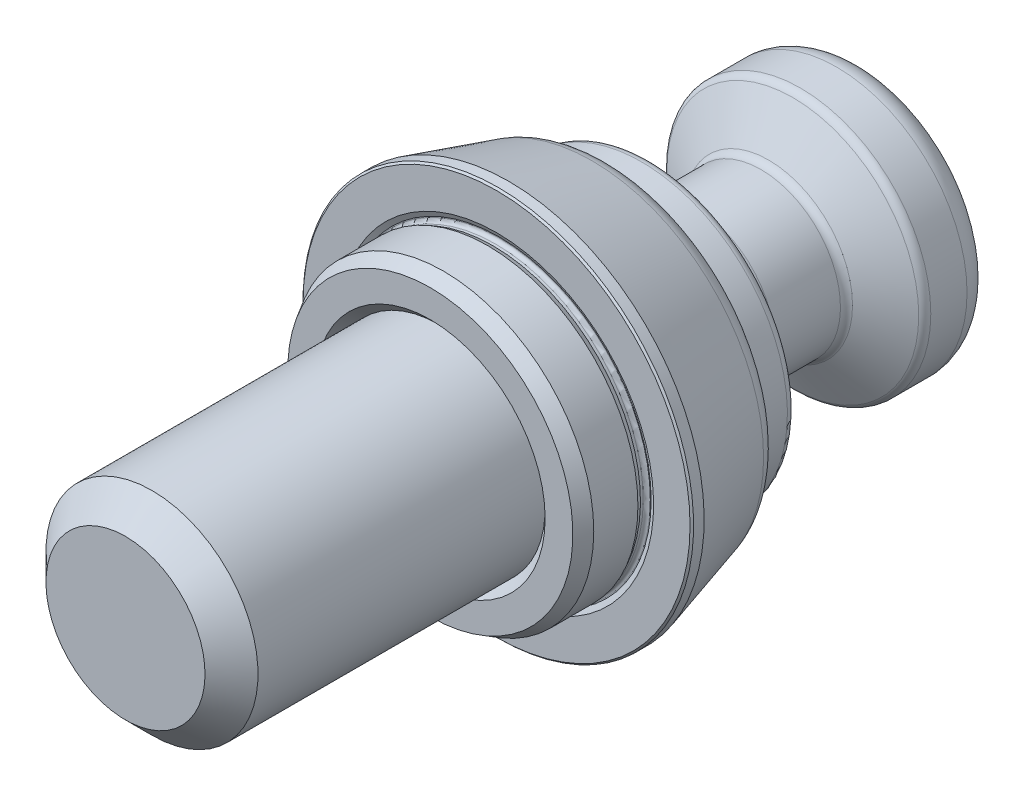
ISO-10303-21;
HEADER;
FILE_DESCRIPTION(('STEP AP214'),'2;1');
FILE_NAME('part.step','',(''),(''),'','','');
FILE_SCHEMA(('AUTOMOTIVE_DESIGN { 1 0 10303 214 1 1 1 1 }'));
ENDSEC;
DATA;
#1=APPLICATION_CONTEXT('core data for automotive mechanical design processes');
#2=APPLICATION_PROTOCOL_DEFINITION('international standard','automotive_design',2000,#1);
#3=PRODUCT_CONTEXT('',#1,'mechanical');
#4=PRODUCT('Part','Part','',(#3));
#5=PRODUCT_RELATED_PRODUCT_CATEGORY('part','',(#4));
#6=PRODUCT_DEFINITION_FORMATION('','',#4);
#7=PRODUCT_DEFINITION_CONTEXT('part definition',#1,'design');
#8=PRODUCT_DEFINITION('design','',#6,#7);
#9=PRODUCT_DEFINITION_SHAPE('','',#8);
#10=(LENGTH_UNIT() NAMED_UNIT(*) SI_UNIT(.MILLI.,.METRE.));
#11=(NAMED_UNIT(*) PLANE_ANGLE_UNIT() SI_UNIT($,.RADIAN.));
#12=(NAMED_UNIT(*) SI_UNIT($,.STERADIAN.) SOLID_ANGLE_UNIT());
#13=UNCERTAINTY_MEASURE_WITH_UNIT(LENGTH_MEASURE(1.E-05),#10,'distance_accuracy_value','');
#14=(GEOMETRIC_REPRESENTATION_CONTEXT(3) GLOBAL_UNCERTAINTY_ASSIGNED_CONTEXT((#13)) GLOBAL_UNIT_ASSIGNED_CONTEXT((#10,
#11,#12)) REPRESENTATION_CONTEXT('',''));
#15=CARTESIAN_POINT('',(0.,0.,0.));
#16=DIRECTION('',(0.,0.,1.));
#17=DIRECTION('',(1.,0.,0.));
#18=AXIS2_PLACEMENT_3D('',#15,#16,#17);
#19=CARTESIAN_POINT('',(17.1,0.,-0.3));
#20=DIRECTION('',(0.,0.,-1.));
#21=DIRECTION('',(0.,1.,0.));
#22=AXIS2_PLACEMENT_3D('',#19,#20,#21);
#23=PLANE('',#22);
#24=CARTESIAN_POINT('',(0.,0.,-0.3));
#25=DIRECTION('',(0.,0.,-1.));
#26=DIRECTION('',(0.,1.,0.));
#27=AXIS2_PLACEMENT_3D('',#24,#25,#26);
#28=CIRCLE('',#27,17.1978793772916);
#29=CARTESIAN_POINT('',(0.,17.1978793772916,-0.3));
#30=VERTEX_POINT('',#29);
#31=EDGE_CURVE('E581',#30,#30,#28,.T.);
#32=ORIENTED_EDGE('',*,*,#31,.F.);
#33=EDGE_LOOP('',(#32));
#34=FACE_BOUND('',#33,.T.);
#35=CARTESIAN_POINT('',(0.,0.,-0.3));
#36=DIRECTION('',(0.,0.,-1.));
#37=DIRECTION('',(0.,1.,0.));
#38=AXIS2_PLACEMENT_3D('',#35,#36,#37);
#39=CIRCLE('',#38,17.1);
#40=CARTESIAN_POINT('',(0.,17.1,-0.3));
#41=VERTEX_POINT('',#40);
#42=EDGE_CURVE('E89',#41,#41,#39,.T.);
#43=ORIENTED_EDGE('',*,*,#42,.T.);
#44=EDGE_LOOP('',(#43));
#45=FACE_BOUND('',#44,.T.);
#46=ADVANCED_FACE('F14',(#34,#45),#23,.F.);
#47=CARTESIAN_POINT('',(0.,0.,0.1));
#48=DIRECTION('',(0.,0.,-1.));
#49=DIRECTION('',(0.,1.,0.));
#50=AXIS2_PLACEMENT_3D('',#47,#48,#49);
#51=TOROIDAL_SURFACE('',#50,17.1,0.4);
#52=ORIENTED_EDGE('',*,*,#42,.F.);
#53=EDGE_LOOP('',(#52));
#54=FACE_BOUND('',#53,.T.);
#55=CARTESIAN_POINT('',(0.,0.,0.1));
#56=DIRECTION('',(0.,0.,-1.));
#57=DIRECTION('',(0.,1.,0.));
#58=AXIS2_PLACEMENT_3D('',#55,#56,#57);
#59=CIRCLE('',#58,16.7);
#60=CARTESIAN_POINT('',(0.,16.7,0.1));
#61=VERTEX_POINT('',#60);
#62=EDGE_CURVE('E596',#61,#61,#59,.T.);
#63=ORIENTED_EDGE('',*,*,#62,.T.);
#64=EDGE_LOOP('',(#63));
#65=FACE_BOUND('',#64,.T.);
#66=ADVANCED_FACE('F556',(#54,#65),#51,.F.);
#67=CARTESIAN_POINT('',(0.,0.,0.));
#68=DIRECTION('',(0.,0.,-1.));
#69=DIRECTION('',(0.,1.,0.));
#70=AXIS2_PLACEMENT_3D('',#67,#68,#69);
#71=CYLINDRICAL_SURFACE('',#70,16.7);
#72=ORIENTED_EDGE('',*,*,#62,.F.);
#73=EDGE_LOOP('',(#72));
#74=FACE_BOUND('',#73,.T.);
#75=CARTESIAN_POINT('',(0.,0.,0.411216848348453));
#76=DIRECTION('',(0.,0.,-1.));
#77=DIRECTION('',(0.,1.,0.));
#78=AXIS2_PLACEMENT_3D('',#75,#76,#77);
#79=CIRCLE('',#78,16.7);
#80=CARTESIAN_POINT('',(0.,16.7,0.411216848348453));
#81=VERTEX_POINT('',#80);
#82=EDGE_CURVE('E593',#81,#81,#79,.T.);
#83=ORIENTED_EDGE('',*,*,#82,.T.);
#84=EDGE_LOOP('',(#83));
#85=FACE_BOUND('',#84,.T.);
#86=ADVANCED_FACE('F546',(#74,#85),#71,.T.);
#87=CARTESIAN_POINT('',(0.,0.,1.));
#88=DIRECTION('',(0.,0.,1.));
#89=DIRECTION('',(0.,-1.,0.));
#90=AXIS2_PLACEMENT_3D('',#87,#88,#89);
#91=CONICAL_SURFACE('',#90,17.,0.47123889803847);
#92=ORIENTED_EDGE('',*,*,#82,.F.);
#93=EDGE_LOOP('',(#92));
#94=FACE_BOUND('',#93,.T.);
#95=CARTESIAN_POINT('',(0.,0.,1.));
#96=DIRECTION('',(0.,0.,-1.));
#97=DIRECTION('',(0.,1.,0.));
#98=AXIS2_PLACEMENT_3D('',#95,#96,#97);
#99=CIRCLE('',#98,17.);
#100=CARTESIAN_POINT('',(0.,17.,1.));
#101=VERTEX_POINT('',#100);
#102=EDGE_CURVE('E590',#101,#101,#99,.T.);
#103=ORIENTED_EDGE('',*,*,#102,.T.);
#104=EDGE_LOOP('',(#103));
#105=FACE_BOUND('',#104,.T.);
#106=ADVANCED_FACE('F536',(#94,#105),#91,.T.);
#107=CARTESIAN_POINT('',(0.,0.,0.));
#108=DIRECTION('',(0.,0.,-1.));
#109=DIRECTION('',(0.,1.,0.));
#110=AXIS2_PLACEMENT_3D('',#107,#108,#109);
#111=CYLINDRICAL_SURFACE('',#110,17.);
#112=ORIENTED_EDGE('',*,*,#102,.F.);
#113=EDGE_LOOP('',(#112));
#114=FACE_BOUND('',#113,.T.);
#115=CARTESIAN_POINT('',(0.,0.,6.));
#116=DIRECTION('',(0.,0.,1.));
#117=DIRECTION('',(0.,-1.,0.));
#118=AXIS2_PLACEMENT_3D('',#115,#116,#117);
#119=CIRCLE('',#118,17.);
#120=CARTESIAN_POINT('',(0.,-17.,6.));
#121=VERTEX_POINT('',#120);
#122=EDGE_CURVE('E608',#121,#121,#119,.F.);
#123=ORIENTED_EDGE('',*,*,#122,.T.);
#124=EDGE_LOOP('',(#123));
#125=FACE_BOUND('',#124,.T.);
#126=ADVANCED_FACE('F526',(#114,#125),#111,.T.);
#127=CARTESIAN_POINT('',(0.,0.,6.));
#128=DIRECTION('',(0.,0.,-1.));
#129=DIRECTION('',(0.,1.,0.));
#130=AXIS2_PLACEMENT_3D('',#127,#128,#129);
#131=CONICAL_SURFACE('',#130,17.,0.523598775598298);
#132=CARTESIAN_POINT('',(0.,0.,7.5));
#133=DIRECTION('',(0.,0.,1.));
#134=DIRECTION('',(0.,-1.,0.));
#135=AXIS2_PLACEMENT_3D('',#132,#133,#134);
#136=CIRCLE('',#135,16.1339745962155);
#137=CARTESIAN_POINT('',(0.,-16.1339745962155,7.5));
#138=VERTEX_POINT('',#137);
#139=EDGE_CURVE('E611',#138,#138,#136,.T.);
#140=ORIENTED_EDGE('',*,*,#139,.F.);
#141=EDGE_LOOP('',(#140));
#142=FACE_BOUND('',#141,.T.);
#143=ORIENTED_EDGE('',*,*,#122,.F.);
#144=EDGE_LOOP('',(#143));
#145=FACE_BOUND('',#144,.T.);
#146=ADVANCED_FACE('F516',(#142,#145),#131,.T.);
#147=CARTESIAN_POINT('',(12.,0.,7.5));
#148=DIRECTION('',(0.,0.,1.));
#149=DIRECTION('',(0.,-1.,0.));
#150=AXIS2_PLACEMENT_3D('',#147,#148,#149);
#151=PLANE('',#150);
#152=CARTESIAN_POINT('',(0.,0.,7.5));
#153=DIRECTION('',(0.,0.,1.));
#154=DIRECTION('',(0.,-1.,0.));
#155=AXIS2_PLACEMENT_3D('',#152,#153,#154);
#156=CIRCLE('',#155,13.);
#157=CARTESIAN_POINT('',(0.,-13.,7.5));
#158=VERTEX_POINT('',#157);
#159=EDGE_CURVE('E614',#158,#158,#156,.F.);
#160=ORIENTED_EDGE('',*,*,#159,.T.);
#161=EDGE_LOOP('',(#160));
#162=FACE_BOUND('',#161,.T.);
#163=ORIENTED_EDGE('',*,*,#139,.T.);
#164=EDGE_LOOP('',(#163));
#165=FACE_BOUND('',#164,.T.);
#166=ADVANCED_FACE('F507',(#162,#165),#151,.T.);
#167=CARTESIAN_POINT('',(0.,0.,7.5));
#168=DIRECTION('',(0.,0.,1.));
#169=DIRECTION('',(0.,-1.,0.));
#170=AXIS2_PLACEMENT_3D('',#167,#168,#169);
#171=CONICAL_SURFACE('',#170,13.,0.785398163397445);
#172=CARTESIAN_POINT('',(0.,0.,6.5));
#173=DIRECTION('',(0.,0.,1.));
#174=DIRECTION('',(0.,-1.,0.));
#175=AXIS2_PLACEMENT_3D('',#172,#173,#174);
#176=CIRCLE('',#175,12.);
#177=CARTESIAN_POINT('',(0.,-12.,6.5));
#178=VERTEX_POINT('',#177);
#179=EDGE_CURVE('E617',#178,#178,#176,.T.);
#180=ORIENTED_EDGE('',*,*,#179,.F.);
#181=EDGE_LOOP('',(#180));
#182=FACE_BOUND('',#181,.T.);
#183=ORIENTED_EDGE('',*,*,#159,.F.);
#184=EDGE_LOOP('',(#183));
#185=FACE_BOUND('',#184,.T.);
#186=ADVANCED_FACE('F497',(#182,#185),#171,.F.);
#187=CARTESIAN_POINT('',(0.,0.,-0.3));
#188=DIRECTION('',(0.,0.,1.));
#189=DIRECTION('',(0.,-1.,0.));
#190=AXIS2_PLACEMENT_3D('',#187,#188,#189);
#191=CONICAL_SURFACE('',#190,17.1978793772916,1.09083078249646);
#192=CARTESIAN_POINT('',(0.,0.,0.));
#193=DIRECTION('',(0.,0.,-1.));
#194=DIRECTION('',(0.,1.,0.));
#195=AXIS2_PLACEMENT_3D('',#192,#193,#194);
#196=CIRCLE('',#195,17.774174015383);
#197=CARTESIAN_POINT('',(0.,17.774174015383,0.));
#198=VERTEX_POINT('',#197);
#199=EDGE_CURVE('E585',#198,#198,#196,.T.);
#200=ORIENTED_EDGE('',*,*,#199,.F.);
#201=EDGE_LOOP('',(#200));
#202=FACE_BOUND('',#201,.T.);
#203=ORIENTED_EDGE('',*,*,#31,.T.);
#204=EDGE_LOOP('',(#203));
#205=FACE_BOUND('',#204,.T.);
#206=ADVANCED_FACE('F487',(#202,#205),#191,.F.);
#207=CARTESIAN_POINT('',(17.,0.,0.));
#208=DIRECTION('',(0.,0.,1.));
#209=DIRECTION('',(0.,-1.,0.));
#210=AXIS2_PLACEMENT_3D('',#207,#208,#209);
#211=PLANE('',#210);
#212=ORIENTED_EDGE('',*,*,#199,.T.);
#213=EDGE_LOOP('',(#212));
#214=FACE_BOUND('',#213,.T.);
#215=CARTESIAN_POINT('',(0.,0.,0.));
#216=DIRECTION('',(0.,0.,1.));
#217=DIRECTION('',(0.,-1.,0.));
#218=AXIS2_PLACEMENT_3D('',#215,#216,#217);
#219=CIRCLE('',#218,21.9);
#220=CARTESIAN_POINT('',(0.,-21.9,0.));
#221=VERTEX_POINT('',#220);
#222=EDGE_CURVE('E29',#221,#221,#219,.T.);
#223=ORIENTED_EDGE('',*,*,#222,.T.);
#224=EDGE_LOOP('',(#223));
#225=FACE_BOUND('',#224,.T.);
#226=ADVANCED_FACE('F478',(#214,#225),#211,.T.);
#227=CARTESIAN_POINT('',(0.,0.,-0.199999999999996));
#228=DIRECTION('',(0.,0.,-1.));
#229=DIRECTION('',(0.,1.,0.));
#230=AXIS2_PLACEMENT_3D('',#227,#228,#229);
#231=CONICAL_SURFACE('',#230,22.1,0.785398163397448);
#232=ORIENTED_EDGE('',*,*,#222,.F.);
#233=EDGE_LOOP('',(#232));
#234=FACE_BOUND('',#233,.T.);
#235=CARTESIAN_POINT('',(0.,0.,-0.199999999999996));
#236=DIRECTION('',(0.,0.,1.));
#237=DIRECTION('',(0.,-1.,0.));
#238=AXIS2_PLACEMENT_3D('',#235,#236,#237);
#239=CIRCLE('',#238,22.1);
#240=CARTESIAN_POINT('',(0.,-22.1,-0.199999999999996));
#241=VERTEX_POINT('',#240);
#242=EDGE_CURVE('E620',#241,#241,#239,.F.);
#243=ORIENTED_EDGE('',*,*,#242,.F.);
#244=EDGE_LOOP('',(#243));
#245=FACE_BOUND('',#244,.T.);
#246=ADVANCED_FACE('F238',(#234,#245),#231,.T.);
#247=CARTESIAN_POINT('',(0.,0.,0.));
#248=DIRECTION('',(0.,0.,-1.));
#249=DIRECTION('',(0.,1.,0.));
#250=AXIS2_PLACEMENT_3D('',#247,#248,#249);
#251=CYLINDRICAL_SURFACE('',#250,22.1);
#252=ORIENTED_EDGE('',*,*,#242,.T.);
#253=EDGE_LOOP('',(#252));
#254=FACE_BOUND('',#253,.T.);
#255=CARTESIAN_POINT('',(0.,0.,-1.3949657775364));
#256=DIRECTION('',(0.,0.,-1.));
#257=DIRECTION('',(0.,1.,0.));
#258=AXIS2_PLACEMENT_3D('',#255,#256,#257);
#259=CIRCLE('',#258,22.1);
#260=CARTESIAN_POINT('',(0.,22.1,-1.3949657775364));
#261=VERTEX_POINT('',#260);
#262=EDGE_CURVE('E599',#261,#261,#259,.T.);
#263=ORIENTED_EDGE('',*,*,#262,.F.);
#264=EDGE_LOOP('',(#263));
#265=FACE_BOUND('',#264,.T.);
#266=ADVANCED_FACE('F459',(#254,#265),#251,.T.);
#267=CARTESIAN_POINT('',(0.,0.,-13.));
#268=DIRECTION('',(0.,0.,1.));
#269=DIRECTION('',(0.,-1.,0.));
#270=AXIS2_PLACEMENT_3D('',#267,#268,#269);
#271=CONICAL_SURFACE('',#270,18.7723099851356,0.279252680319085);
#272=CARTESIAN_POINT('',(0.,0.,-10.826912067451));
#273=DIRECTION('',(0.,0.,-1.));
#274=DIRECTION('',(0.,1.,0.));
#275=AXIS2_PLACEMENT_3D('',#272,#273,#274);
#276=CIRCLE('',#275,19.3954329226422);
#277=CARTESIAN_POINT('',(0.,19.3954329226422,-10.826912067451));
#278=VERTEX_POINT('',#277);
#279=EDGE_CURVE('E605',#278,#278,#276,.F.);
#280=ORIENTED_EDGE('',*,*,#279,.T.);
#281=EDGE_LOOP('',(#280));
#282=FACE_BOUND('',#281,.T.);
#283=ORIENTED_EDGE('',*,*,#262,.T.);
#284=EDGE_LOOP('',(#283));
#285=FACE_BOUND('',#284,.T.);
#286=ADVANCED_FACE('F449',(#282,#285),#271,.T.);
#287=CARTESIAN_POINT('',(0.,0.,-10.));
#288=DIRECTION('',(0.,0.,-1.));
#289=DIRECTION('',(0.,1.,0.));
#290=AXIS2_PLACEMENT_3D('',#287,#288,#289);
#291=TOROIDAL_SURFACE('',#290,16.5116478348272,3.);
#292=ORIENTED_EDGE('',*,*,#279,.F.);
#293=EDGE_LOOP('',(#292));
#294=FACE_BOUND('',#293,.T.);
#295=CARTESIAN_POINT('',(0.,0.,-13.));
#296=DIRECTION('',(0.,0.,-1.));
#297=DIRECTION('',(0.,1.,0.));
#298=AXIS2_PLACEMENT_3D('',#295,#296,#297);
#299=CIRCLE('',#298,16.5116478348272);
#300=CARTESIAN_POINT('',(0.,16.5116478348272,-13.));
#301=VERTEX_POINT('',#300);
#302=EDGE_CURVE('E602',#301,#301,#299,.T.);
#303=ORIENTED_EDGE('',*,*,#302,.F.);
#304=EDGE_LOOP('',(#303));
#305=FACE_BOUND('',#304,.T.);
#306=ADVANCED_FACE('F439',(#294,#305),#291,.T.);
#307=CARTESIAN_POINT('',(12.,0.,-13.));
#308=DIRECTION('',(0.,0.,-1.));
#309=DIRECTION('',(0.,1.,0.));
#310=AXIS2_PLACEMENT_3D('',#307,#308,#309);
#311=PLANE('',#310);
#312=CARTESIAN_POINT('',(0.,0.,-13.));
#313=DIRECTION('',(0.,0.,-1.));
#314=DIRECTION('',(-1.,0.,0.));
#315=AXIS2_PLACEMENT_3D('',#312,#313,#314);
#316=CIRCLE('',#315,16.);
#317=CARTESIAN_POINT('',(-16.,0.,-13.));
#318=VERTEX_POINT('',#317);
#319=EDGE_CURVE('E9',#318,#318,#316,.T.);
#320=ORIENTED_EDGE('',*,*,#319,.F.);
#321=EDGE_LOOP('',(#320));
#322=FACE_BOUND('',#321,.T.);
#323=ORIENTED_EDGE('',*,*,#302,.T.);
#324=EDGE_LOOP('',(#323));
#325=FACE_BOUND('',#324,.T.);
#326=ADVANCED_FACE('F153',(#322,#325),#311,.T.);
#327=CARTESIAN_POINT('',(0.,0.,42.));
#328=DIRECTION('',(0.,0.,1.));
#329=DIRECTION('',(0.,1.,0.));
#330=AXIS2_PLACEMENT_3D('',#327,#328,#329);
#331=PLANE('',#330);
#332=CARTESIAN_POINT('',(0.,0.,42.));
#333=DIRECTION('',(0.,0.,1.));
#334=DIRECTION('',(0.,1.,0.));
#335=AXIS2_PLACEMENT_3D('',#332,#333,#334);
#336=CIRCLE('',#335,9.);
#337=CARTESIAN_POINT('',(0.,9.,42.));
#338=VERTEX_POINT('',#337);
#339=EDGE_CURVE('E130',#338,#338,#336,.T.);
#340=ORIENTED_EDGE('',*,*,#339,.T.);
#341=EDGE_LOOP('',(#340));
#342=FACE_BOUND('',#341,.T.);
#343=ADVANCED_FACE('F166',(#342),#331,.T.);
#344=CARTESIAN_POINT('',(0.,0.,39.));
#345=DIRECTION('',(0.,0.,-1.));
#346=DIRECTION('',(0.,-1.,0.));
#347=AXIS2_PLACEMENT_3D('',#344,#345,#346);
#348=CONICAL_SURFACE('',#347,12.,0.78539816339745);
#349=ORIENTED_EDGE('',*,*,#339,.F.);
#350=EDGE_LOOP('',(#349));
#351=FACE_BOUND('',#350,.T.);
#352=CARTESIAN_POINT('',(0.,0.,39.));
#353=DIRECTION('',(0.,0.,1.));
#354=DIRECTION('',(0.,1.,0.));
#355=AXIS2_PLACEMENT_3D('',#352,#353,#354);
#356=CIRCLE('',#355,12.);
#357=CARTESIAN_POINT('',(0.,12.,39.));
#358=VERTEX_POINT('',#357);
#359=EDGE_CURVE('E127',#358,#358,#356,.F.);
#360=ORIENTED_EDGE('',*,*,#359,.F.);
#361=EDGE_LOOP('',(#360));
#362=FACE_BOUND('',#361,.T.);
#363=ADVANCED_FACE('F163',(#351,#362),#348,.T.);
#364=CARTESIAN_POINT('',(0.,0.,-13.));
#365=DIRECTION('',(0.,0.,-1.));
#366=DIRECTION('',(0.,-1.,0.));
#367=AXIS2_PLACEMENT_3D('',#364,#365,#366);
#368=CYLINDRICAL_SURFACE('',#367,12.);
#369=ORIENTED_EDGE('',*,*,#359,.T.);
#370=EDGE_LOOP('',(#369));
#371=FACE_BOUND('',#370,.T.);
#372=ORIENTED_EDGE('',*,*,#179,.T.);
#373=EDGE_LOOP('',(#372));
#374=FACE_BOUND('',#373,.T.);
#375=ADVANCED_FACE('F165',(#371,#374),#368,.T.);
#376=CARTESIAN_POINT('',(0.,0.,-36.));
#377=DIRECTION('',(0.,0.,-1.));
#378=DIRECTION('',(0.,-1.,0.));
#379=AXIS2_PLACEMENT_3D('',#376,#377,#378);
#380=PLANE('',#379);
#381=DIRECTION('',(-0.5,-0.866025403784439,0.));
#382=VECTOR('',#381,1.);
#383=CARTESIAN_POINT('',(4.61880215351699,0.,-36.));
#384=LINE('',#383,#382);
#385=CARTESIAN_POINT('',(4.61880215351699,0.,-36.));
#386=VERTEX_POINT('',#385);
#387=CARTESIAN_POINT('',(2.30940107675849,-4.,-36.));
#388=VERTEX_POINT('',#387);
#389=EDGE_CURVE('E99',#386,#388,#384,.T.);
#390=ORIENTED_EDGE('',*,*,#389,.T.);
#391=DIRECTION('',(-1.,0.,0.));
#392=VECTOR('',#391,1.);
#393=CARTESIAN_POINT('',(2.30940107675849,-4.,-36.));
#394=LINE('',#393,#392);
#395=CARTESIAN_POINT('',(-2.30940107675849,-4.,-36.));
#396=VERTEX_POINT('',#395);
#397=EDGE_CURVE('E95',#388,#396,#394,.T.);
#398=ORIENTED_EDGE('',*,*,#397,.T.);
#399=DIRECTION('',(-0.5,0.86602540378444,0.));
#400=VECTOR('',#399,1.);
#401=CARTESIAN_POINT('',(-2.30940107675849,-4.,-36.));
#402=LINE('',#401,#400);
#403=CARTESIAN_POINT('',(-4.61880215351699,0.,-36.));
#404=VERTEX_POINT('',#403);
#405=EDGE_CURVE('E45',#396,#404,#402,.T.);
#406=ORIENTED_EDGE('',*,*,#405,.T.);
#407=DIRECTION('',(0.5,0.866025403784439,0.));
#408=VECTOR('',#407,1.);
#409=CARTESIAN_POINT('',(-4.61880215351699,0.,-36.));
#410=LINE('',#409,#408);
#411=CARTESIAN_POINT('',(-2.30940107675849,4.,-36.));
#412=VERTEX_POINT('',#411);
#413=EDGE_CURVE('E93',#404,#412,#410,.T.);
#414=ORIENTED_EDGE('',*,*,#413,.T.);
#415=DIRECTION('',(1.,0.,0.));
#416=VECTOR('',#415,1.);
#417=CARTESIAN_POINT('',(-2.30940107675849,4.,-36.));
#418=LINE('',#417,#416);
#419=CARTESIAN_POINT('',(2.30940107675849,4.,-36.));
#420=VERTEX_POINT('',#419);
#421=EDGE_CURVE('E278',#412,#420,#418,.T.);
#422=ORIENTED_EDGE('',*,*,#421,.T.);
#423=DIRECTION('',(0.5,-0.866025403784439,0.));
#424=VECTOR('',#423,1.);
#425=CARTESIAN_POINT('',(2.30940107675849,4.,-36.));
#426=LINE('',#425,#424);
#427=EDGE_CURVE('E281',#420,#386,#426,.T.);
#428=ORIENTED_EDGE('',*,*,#427,.T.);
#429=EDGE_LOOP('',(#390,#398,#406,#414,#422,#428));
#430=FACE_BOUND('',#429,.T.);
#431=ADVANCED_FACE('F158',(#430),#380,.T.);
#432=CARTESIAN_POINT('',(4.61880215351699,0.,-36.));
#433=DIRECTION('',(0.866025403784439,-0.5,0.));
#434=DIRECTION('',(0.5,0.866025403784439,0.));
#435=AXIS2_PLACEMENT_3D('',#432,#433,#434);
#436=PLANE('',#435);
#437=DIRECTION('',(0.,0.,-1.));
#438=VECTOR('',#437,1.);
#439=CARTESIAN_POINT('',(4.61880215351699,0.,-36.));
#440=LINE('',#439,#438);
#441=CARTESIAN_POINT('',(4.61880215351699,0.,-41.2799153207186));
#442=VERTEX_POINT('',#441);
#443=EDGE_CURVE('E292',#386,#442,#440,.T.);
#444=ORIENTED_EDGE('',*,*,#443,.T.);
#445=CARTESIAN_POINT('',(4.61891762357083,0.000199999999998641,-41.2799819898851));
#446=CARTESIAN_POINT('',(4.51743148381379,-0.175579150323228,-41.2213676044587));
#447=CARTESIAN_POINT('',(4.4150693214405,-0.352875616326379,-41.1680600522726));
#448=CARTESIAN_POINT('',(4.20857250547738,-0.710538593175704,-41.0750114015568));
#449=CARTESIAN_POINT('',(4.10443418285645,-0.890911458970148,-41.0353032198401));
#450=CARTESIAN_POINT('',(3.89744813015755,-1.24942181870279,-40.9734919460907));
#451=CARTESIAN_POINT('',(3.79463224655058,-1.42750415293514,-40.9509774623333));
#452=CARTESIAN_POINT('',(3.58851671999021,-1.7845067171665,-40.924100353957));
#453=CARTESIAN_POINT('',(3.48521782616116,-1.96342564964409,-40.9197154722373));
#454=CARTESIAN_POINT('',(3.29219970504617,-2.29774284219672,-40.9288398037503));
#455=CARTESIAN_POINT('',(3.20245157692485,-2.45319115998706,-40.9401086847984));
#456=CARTESIAN_POINT('',(3.02354002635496,-2.76307505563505,-40.9758237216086));
#457=CARTESIAN_POINT('',(2.93437722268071,-2.91750956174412,-41.0002820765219));
#458=CARTESIAN_POINT('',(2.75509682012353,-3.22803232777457,-41.0614257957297));
#459=CARTESIAN_POINT('',(2.66500191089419,-3.3840812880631,-41.0983703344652));
#460=CARTESIAN_POINT('',(2.48615580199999,-3.69385183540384,-41.1822198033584));
#461=CARTESIAN_POINT('',(2.39740231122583,-3.84757739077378,-41.2291050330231));
#462=CARTESIAN_POINT('',(2.30928560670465,-4.0002,-41.2799819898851));
#463=B_SPLINE_CURVE_WITH_KNOTS('',3,(#445,#446,#447,#448,#449,#450,#451,#452,#453,#454,#455,
#456,#457,#458,#459,#460,#461,#462),.UNSPECIFIED.,.F.,.F.,(4,2,2,2,2,2,2,2,4),(0.,
0.634047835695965,1.26961969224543,1.88946157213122,2.50854226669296,3.04757825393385,
3.58711366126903,4.13861653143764,4.68903648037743),.UNSPECIFIED.);
#464=CARTESIAN_POINT('',(2.30940107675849,-4.,-41.2799153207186));
#465=VERTEX_POINT('',#464);
#466=EDGE_CURVE('E251',#442,#465,#463,.T.);
#467=ORIENTED_EDGE('',*,*,#466,.T.);
#468=DIRECTION('',(0.,0.,-1.));
#469=VECTOR('',#468,1.);
#470=CARTESIAN_POINT('',(2.30940107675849,-4.,-36.));
#471=LINE('',#470,#469);
#472=EDGE_CURVE('E289',#388,#465,#471,.T.);
#473=ORIENTED_EDGE('',*,*,#472,.F.);
#474=ORIENTED_EDGE('',*,*,#389,.F.);
#475=EDGE_LOOP('',(#444,#467,#473,#474));
#476=FACE_BOUND('',#475,.T.);
#477=ADVANCED_FACE('F260',(#476),#436,.F.);
#478=CARTESIAN_POINT('',(2.30940107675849,-4.,-36.));
#479=DIRECTION('',(0.,-1.,0.));
#480=DIRECTION('',(1.,0.,0.));
#481=AXIS2_PLACEMENT_3D('',#478,#479,#480);
#482=PLANE('',#481);
#483=ORIENTED_EDGE('',*,*,#472,.T.);
#484=CARTESIAN_POINT('',(6.15545088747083,-4.,-42.8515492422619));
#485=CARTESIAN_POINT('',(5.98114186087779,-4.,-42.7671874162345));
#486=CARTESIAN_POINT('',(5.80642751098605,-4.,-42.683648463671));
#487=CARTESIAN_POINT('',(5.45597243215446,-4.,-42.5186800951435));
#488=CARTESIAN_POINT('',(5.28023154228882,-4.,-42.4372510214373));
#489=CARTESIAN_POINT('',(4.92657895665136,-4.,-42.276546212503));
#490=CARTESIAN_POINT('',(4.74866061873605,-4.,-42.1972850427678));
#491=CARTESIAN_POINT('',(4.39139197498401,-4.,-42.0420709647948));
#492=CARTESIAN_POINT('',(4.21204173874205,-4.,-41.9661178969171));
#493=CARTESIAN_POINT('',(3.84601982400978,-4.,-41.8160980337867));
#494=CARTESIAN_POINT('',(3.65929378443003,-4.,-41.7421631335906));
#495=CARTESIAN_POINT('',(3.28363946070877,-4.,-41.6000059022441));
#496=CARTESIAN_POINT('',(3.09471092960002,-4.,-41.5317842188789));
#497=CARTESIAN_POINT('',(2.7147205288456,-4.,-41.4028795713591));
#498=CARTESIAN_POINT('',(2.52366403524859,-4.,-41.3421809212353));
#499=CARTESIAN_POINT('',(2.13881115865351,-4.,-41.2303016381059));
#500=CARTESIAN_POINT('',(1.94501567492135,-4.,-41.1791179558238));
#501=CARTESIAN_POINT('',(1.5556428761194,-4.,-41.0890262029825));
#502=CARTESIAN_POINT('',(1.36008084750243,-4.,-41.0500532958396));
#503=CARTESIAN_POINT('',(0.966575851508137,-4.,-40.9866183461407));
#504=CARTESIAN_POINT('',(0.768633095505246,-4.,-40.9621550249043));
#505=CARTESIAN_POINT('',(0.373920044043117,-4.,-40.9300119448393));
#506=CARTESIAN_POINT('',(0.177167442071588,-4.,-40.9221202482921));
#507=CARTESIAN_POINT('',(-0.216304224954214,-4.,-40.9232344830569));
#508=CARTESIAN_POINT('',(-0.413023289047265,-4.,-40.9322408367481));
#509=CARTESIAN_POINT('',(-0.748437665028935,-4.,-40.9613733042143));
#510=CARTESIAN_POINT('',(-0.887496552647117,-4.,-40.9775408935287));
#511=CARTESIAN_POINT('',(-1.16455854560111,-4.,-41.0172870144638));
#512=CARTESIAN_POINT('',(-1.30256149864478,-4.,-41.0408665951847));
#513=CARTESIAN_POINT('',(-1.71482433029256,-4.,-41.1214799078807));
#514=CARTESIAN_POINT('',(-1.98717590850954,-4.,-41.1883722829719));
#515=CARTESIAN_POINT('',(-2.39434499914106,-4.,-41.3038808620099));
#516=CARTESIAN_POINT('',(-2.53128526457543,-4.,-41.3454363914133));
#517=CARTESIAN_POINT('',(-2.80383477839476,-4.,-41.4327425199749));
#518=CARTESIAN_POINT('',(-2.93944401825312,-4.,-41.4784931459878));
#519=CARTESIAN_POINT('',(-3.2093767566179,-4.,-41.5734654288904));
#520=CARTESIAN_POINT('',(-3.34370069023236,-4.,-41.6226858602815));
#521=CARTESIAN_POINT('',(-3.61124396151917,-4.,-41.7240308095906));
#522=CARTESIAN_POINT('',(-3.74446330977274,-4.,-41.7761552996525));
#523=CARTESIAN_POINT('',(-4.04870128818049,-4.,-41.8984071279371));
#524=CARTESIAN_POINT('',(-4.21939338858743,-4.,-41.9693453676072));
#525=CARTESIAN_POINT('',(-4.55940655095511,-4.,-42.1144431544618));
#526=CARTESIAN_POINT('',(-4.7287275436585,-4.,-42.1886028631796));
#527=CARTESIAN_POINT('',(-5.06623845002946,-4.,-42.3395234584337));
#528=CARTESIAN_POINT('',(-5.2344281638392,-4.,-42.4162847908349));
#529=CARTESIAN_POINT('',(-5.56983155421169,-4.,-42.5719139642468));
#530=CARTESIAN_POINT('',(-5.73704521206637,-4.,-42.6507818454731));
#531=CARTESIAN_POINT('',(-6.2377505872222,-4.,-42.8900959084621));
#532=CARTESIAN_POINT('',(-6.57001042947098,-4.,-43.0531183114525));
#533=CARTESIAN_POINT('',(-7.23217091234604,-4.,-43.3838840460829));
#534=CARTESIAN_POINT('',(-7.56207147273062,-4.,-43.5516275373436));
#535=CARTESIAN_POINT('',(-8.19416831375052,-4.,-43.8771399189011));
#536=CARTESIAN_POINT('',(-8.49649716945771,-4.,-44.0346518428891));
#537=CARTESIAN_POINT('',(-9.10001953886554,-4.,-44.3518544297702));
#538=CARTESIAN_POINT('',(-9.40121301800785,-4.,-44.5115451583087));
#539=CARTESIAN_POINT('',(-10.0020291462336,-4.,-44.8322374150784));
#540=CARTESIAN_POINT('',(-10.3016538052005,-4.,-44.9932351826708));
#541=CARTESIAN_POINT('',(-10.9001707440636,-4.,-45.3165512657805));
#542=CARTESIAN_POINT('',(-11.1990630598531,-4.,-45.4788695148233));
#543=CARTESIAN_POINT('',(-11.4976828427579,-4.,-45.641684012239));
#544=B_SPLINE_CURVE_WITH_KNOTS('',3,(#484,#485,#486,#487,#488,#489,#490,#491,#492,#493,#494,
#495,#496,#497,#498,#499,#500,#501,#502,#503,#504,#505,#506,#507,#508,#509,#510,#511,#512,#513,
#514,#515,#516,#517,#518,#519,#520,#521,#522,#523,#524,#525,#526,#527,#528,#529,#530,#531,#532,
#533,#534,#535,#536,#537,#538,#539,#540,#541,#542,#543),.UNSPECIFIED.,.F.,.F.,(4,2,2,2,2,2,2,2,
2,2,2,2,2,2,2,2,2,2,2,2,2,2,2,2,2,2,2,2,2,4),(0.,0.58095913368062,1.16201192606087,
1.74630973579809,2.33057931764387,2.93299929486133,3.53548748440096,4.13669752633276,
4.73771456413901,5.33548401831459,5.93320078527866,6.5232254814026,7.11326492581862,
7.53304708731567,7.95288869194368,8.79305885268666,9.22234391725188,9.65163173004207,
10.0807686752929,10.5099015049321,11.0643958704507,11.6189180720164,12.1735357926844,
12.7281641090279,13.838396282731,14.9486660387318,15.9713541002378,16.9940730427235,
18.0144894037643,19.0348547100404),.UNSPECIFIED.);
#545=CARTESIAN_POINT('',(-2.30940107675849,-4.,-41.2799153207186));
#546=VERTEX_POINT('',#545);
#547=EDGE_CURVE('E83',#465,#546,#544,.T.);
#548=ORIENTED_EDGE('',*,*,#547,.T.);
#549=DIRECTION('',(0.,0.,-1.));
#550=VECTOR('',#549,1.);
#551=CARTESIAN_POINT('',(-2.30940107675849,-4.,-36.));
#552=LINE('',#551,#550);
#553=EDGE_CURVE('E81',#396,#546,#552,.T.);
#554=ORIENTED_EDGE('',*,*,#553,.F.);
#555=ORIENTED_EDGE('',*,*,#397,.F.);
#556=EDGE_LOOP('',(#483,#548,#554,#555));
#557=FACE_BOUND('',#556,.T.);
#558=ADVANCED_FACE('F214',(#557),#482,.F.);
#559=CARTESIAN_POINT('',(-2.30940107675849,-4.,-36.));
#560=DIRECTION('',(-0.86602540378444,-0.5,0.));
#561=DIRECTION('',(0.5,-0.86602540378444,0.));
#562=AXIS2_PLACEMENT_3D('',#559,#560,#561);
#563=PLANE('',#562);
#564=ORIENTED_EDGE('',*,*,#553,.T.);
#565=CARTESIAN_POINT('',(-2.30928560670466,-4.0002,-41.2799819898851));
#566=CARTESIAN_POINT('',(-2.4107717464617,-3.82442084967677,-41.2213676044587));
#567=CARTESIAN_POINT('',(-2.51313390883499,-3.64712438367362,-41.1680600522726));
#568=CARTESIAN_POINT('',(-2.71963072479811,-3.28946140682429,-41.0750114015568));
#569=CARTESIAN_POINT('',(-2.82376904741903,-3.10908854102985,-41.0353032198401));
#570=CARTESIAN_POINT('',(-3.03075510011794,-2.75057818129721,-40.9734919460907));
#571=CARTESIAN_POINT('',(-3.13357098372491,-2.57249584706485,-40.9509774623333));
#572=CARTESIAN_POINT('',(-3.33968651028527,-2.21549328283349,-40.924100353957));
#573=CARTESIAN_POINT('',(-3.44298540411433,-2.03657435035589,-40.9197154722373));
#574=CARTESIAN_POINT('',(-3.63600352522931,-1.70225715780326,-40.9288398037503));
#575=CARTESIAN_POINT('',(-3.72575165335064,-1.54680884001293,-40.9401086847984));
#576=CARTESIAN_POINT('',(-3.90466320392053,-1.23692494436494,-40.9758237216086));
#577=CARTESIAN_POINT('',(-3.99382600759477,-1.08249043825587,-41.0002820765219));
#578=CARTESIAN_POINT('',(-4.17310641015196,-0.77196767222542,-41.0614257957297));
#579=CARTESIAN_POINT('',(-4.2632013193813,-0.615918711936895,-41.0983703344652));
#580=CARTESIAN_POINT('',(-4.44204742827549,-0.306148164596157,-41.1822198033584));
#581=CARTESIAN_POINT('',(-4.53080091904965,-0.152422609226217,-41.2291050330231));
#582=CARTESIAN_POINT('',(-4.61891762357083,0.00020000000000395,-41.2799819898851));
#583=B_SPLINE_CURVE_WITH_KNOTS('',3,(#565,#566,#567,#568,#569,#570,#571,#572,#573,#574,#575,
#576,#577,#578,#579,#580,#581,#582),.UNSPECIFIED.,.F.,.F.,(4,2,2,2,2,2,2,2,4),(0.,
0.634047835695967,1.26961969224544,1.88946157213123,2.50854226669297,3.04757825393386,
3.58711366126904,4.13861653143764,4.68903648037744),.UNSPECIFIED.);
#584=CARTESIAN_POINT('',(-4.61880215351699,0.,-41.2799153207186));
#585=VERTEX_POINT('',#584);
#586=EDGE_CURVE('E76',#546,#585,#583,.T.);
#587=ORIENTED_EDGE('',*,*,#586,.T.);
#588=DIRECTION('',(0.,0.,-1.));
#589=VECTOR('',#588,1.);
#590=CARTESIAN_POINT('',(-4.61880215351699,0.,-36.));
#591=LINE('',#590,#589);
#592=EDGE_CURVE('E79',#404,#585,#591,.T.);
#593=ORIENTED_EDGE('',*,*,#592,.F.);
#594=ORIENTED_EDGE('',*,*,#405,.F.);
#595=EDGE_LOOP('',(#564,#587,#593,#594));
#596=FACE_BOUND('',#595,.T.);
#597=ADVANCED_FACE('F77',(#596),#563,.F.);
#598=CARTESIAN_POINT('',(-4.61880215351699,0.,-36.));
#599=DIRECTION('',(-0.866025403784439,0.5,0.));
#600=DIRECTION('',(-0.5,-0.866025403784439,0.));
#601=AXIS2_PLACEMENT_3D('',#598,#599,#600);
#602=PLANE('',#601);
#603=ORIENTED_EDGE('',*,*,#592,.T.);
#604=CARTESIAN_POINT('',(-4.61891762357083,-0.00019999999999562,-41.2799819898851));
#605=CARTESIAN_POINT('',(-4.51743148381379,0.175579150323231,-41.2213676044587));
#606=CARTESIAN_POINT('',(-4.4150693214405,0.352875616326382,-41.1680600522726));
#607=CARTESIAN_POINT('',(-4.20857250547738,0.710538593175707,-41.0750114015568));
#608=CARTESIAN_POINT('',(-4.10443418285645,0.890911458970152,-41.0353032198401));
#609=CARTESIAN_POINT('',(-3.89744813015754,1.24942181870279,-40.9734919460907));
#610=CARTESIAN_POINT('',(-3.79463224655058,1.42750415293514,-40.9509774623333));
#611=CARTESIAN_POINT('',(-3.58851671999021,1.78450671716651,-40.924100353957));
#612=CARTESIAN_POINT('',(-3.48521782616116,1.9634256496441,-40.9197154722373));
#613=CARTESIAN_POINT('',(-3.29219970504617,2.29774284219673,-40.9288398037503));
#614=CARTESIAN_POINT('',(-3.20245157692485,2.45319115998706,-40.9401086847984));
#615=CARTESIAN_POINT('',(-3.02354002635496,2.76307505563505,-40.9758237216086));
#616=CARTESIAN_POINT('',(-2.93437722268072,2.91750956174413,-41.0002820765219));
#617=CARTESIAN_POINT('',(-2.75509682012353,3.22803232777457,-41.0614257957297));
#618=CARTESIAN_POINT('',(-2.66500191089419,3.3840812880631,-41.0983703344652));
#619=CARTESIAN_POINT('',(-2.48615580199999,3.69385183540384,-41.1822198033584));
#620=CARTESIAN_POINT('',(-2.39740231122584,3.84757739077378,-41.2291050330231));
#621=CARTESIAN_POINT('',(-2.30928560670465,4.0002,-41.2799819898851));
#622=B_SPLINE_CURVE_WITH_KNOTS('',3,(#604,#605,#606,#607,#608,#609,#610,#611,#612,#613,#614,
#615,#616,#617,#618,#619,#620,#621),.UNSPECIFIED.,.F.,.F.,(4,2,2,2,2,2,2,2,4),(0.,
0.634047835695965,1.26961969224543,1.88946157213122,2.50854226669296,3.04757825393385,
3.58711366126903,4.13861653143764,4.68903648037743),.UNSPECIFIED.);
#623=CARTESIAN_POINT('',(-2.30940107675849,4.,-41.2799153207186));
#624=VERTEX_POINT('',#623);
#625=EDGE_CURVE('E18',#585,#624,#622,.T.);
#626=ORIENTED_EDGE('',*,*,#625,.T.);
#627=DIRECTION('',(0.,0.,-1.));
#628=VECTOR('',#627,1.);
#629=CARTESIAN_POINT('',(-2.30940107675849,4.,-36.));
#630=LINE('',#629,#628);
#631=EDGE_CURVE('E94',#412,#624,#630,.T.);
#632=ORIENTED_EDGE('',*,*,#631,.F.);
#633=ORIENTED_EDGE('',*,*,#413,.F.);
#634=EDGE_LOOP('',(#603,#626,#632,#633));
#635=FACE_BOUND('',#634,.T.);
#636=ADVANCED_FACE('F91',(#635),#602,.F.);
#637=CARTESIAN_POINT('',(-2.30940107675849,4.,-36.));
#638=DIRECTION('',(0.,1.,0.));
#639=DIRECTION('',(-1.,0.,0.));
#640=AXIS2_PLACEMENT_3D('',#637,#638,#639);
#641=PLANE('',#640);
#642=ORIENTED_EDGE('',*,*,#631,.T.);
#643=CARTESIAN_POINT('',(6.15545088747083,4.,-42.8515492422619));
#644=CARTESIAN_POINT('',(5.98114186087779,4.,-42.7671874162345));
#645=CARTESIAN_POINT('',(5.80642751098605,4.,-42.683648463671));
#646=CARTESIAN_POINT('',(5.45597243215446,4.,-42.5186800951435));
#647=CARTESIAN_POINT('',(5.28023154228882,4.,-42.4372510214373));
#648=CARTESIAN_POINT('',(4.92657895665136,4.,-42.276546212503));
#649=CARTESIAN_POINT('',(4.74866061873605,4.,-42.1972850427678));
#650=CARTESIAN_POINT('',(4.39139197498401,4.,-42.0420709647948));
#651=CARTESIAN_POINT('',(4.21204173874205,4.,-41.9661178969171));
#652=CARTESIAN_POINT('',(3.84601982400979,4.,-41.8160980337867));
#653=CARTESIAN_POINT('',(3.65929378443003,4.,-41.7421631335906));
#654=CARTESIAN_POINT('',(3.28363946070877,4.,-41.6000059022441));
#655=CARTESIAN_POINT('',(3.09471092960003,4.,-41.531784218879));
#656=CARTESIAN_POINT('',(2.7147205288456,4.,-41.4028795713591));
#657=CARTESIAN_POINT('',(2.5236640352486,4.,-41.3421809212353));
#658=CARTESIAN_POINT('',(2.13881115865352,4.,-41.2303016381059));
#659=CARTESIAN_POINT('',(1.94501567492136,4.,-41.1791179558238));
#660=CARTESIAN_POINT('',(1.55564287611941,4.,-41.0890262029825));
#661=CARTESIAN_POINT('',(1.36008084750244,4.,-41.0500532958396));
#662=CARTESIAN_POINT('',(0.966575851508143,4.,-40.9866183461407));
#663=CARTESIAN_POINT('',(0.768633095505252,4.,-40.9621550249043));
#664=CARTESIAN_POINT('',(0.373920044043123,4.,-40.9300119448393));
#665=CARTESIAN_POINT('',(0.177167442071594,4.,-40.9221202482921));
#666=CARTESIAN_POINT('',(-0.216304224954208,4.,-40.9232344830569));
#667=CARTESIAN_POINT('',(-0.413023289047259,4.,-40.9322408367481));
#668=CARTESIAN_POINT('',(-0.748437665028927,4.,-40.9613733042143));
#669=CARTESIAN_POINT('',(-0.887496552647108,4.,-40.9775408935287));
#670=CARTESIAN_POINT('',(-1.1645585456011,4.,-41.0172870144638));
#671=CARTESIAN_POINT('',(-1.30256149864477,4.,-41.0408665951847));
#672=CARTESIAN_POINT('',(-1.71482433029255,4.,-41.1214799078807));
#673=CARTESIAN_POINT('',(-1.98717590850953,4.,-41.1883722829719));
#674=CARTESIAN_POINT('',(-2.39434499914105,4.,-41.3038808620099));
#675=CARTESIAN_POINT('',(-2.53128526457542,4.,-41.3454363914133));
#676=CARTESIAN_POINT('',(-2.80383477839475,4.,-41.4327425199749));
#677=CARTESIAN_POINT('',(-2.93944401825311,4.,-41.4784931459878));
#678=CARTESIAN_POINT('',(-3.20937675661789,4.,-41.5734654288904));
#679=CARTESIAN_POINT('',(-3.34370069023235,4.,-41.6226858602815));
#680=CARTESIAN_POINT('',(-3.61124396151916,4.,-41.7240308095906));
#681=CARTESIAN_POINT('',(-3.74446330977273,4.,-41.7761552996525));
#682=CARTESIAN_POINT('',(-4.04870128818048,4.,-41.8984071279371));
#683=CARTESIAN_POINT('',(-4.21939338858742,4.,-41.9693453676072));
#684=CARTESIAN_POINT('',(-4.55940655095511,4.,-42.1144431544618));
#685=CARTESIAN_POINT('',(-4.72872754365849,4.,-42.1886028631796));
#686=CARTESIAN_POINT('',(-5.06623845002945,4.,-42.3395234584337));
#687=CARTESIAN_POINT('',(-5.2344281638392,4.,-42.4162847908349));
#688=CARTESIAN_POINT('',(-5.56983155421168,4.,-42.5719139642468));
#689=CARTESIAN_POINT('',(-5.73704521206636,4.,-42.6507818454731));
#690=CARTESIAN_POINT('',(-6.23775058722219,4.,-42.8900959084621));
#691=CARTESIAN_POINT('',(-6.57001042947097,4.,-43.0531183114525));
#692=CARTESIAN_POINT('',(-7.23217091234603,4.,-43.3838840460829));
#693=CARTESIAN_POINT('',(-7.56207147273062,4.,-43.5516275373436));
#694=CARTESIAN_POINT('',(-8.19416831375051,4.,-43.8771399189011));
#695=CARTESIAN_POINT('',(-8.4964971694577,4.,-44.0346518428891));
#696=CARTESIAN_POINT('',(-9.10001953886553,4.,-44.3518544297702));
#697=CARTESIAN_POINT('',(-9.40121301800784,4.,-44.5115451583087));
#698=CARTESIAN_POINT('',(-10.0020291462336,4.,-44.8322374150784));
#699=CARTESIAN_POINT('',(-10.3016538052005,4.,-44.9932351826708));
#700=CARTESIAN_POINT('',(-10.9001707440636,4.,-45.3165512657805));
#701=CARTESIAN_POINT('',(-11.1990630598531,4.,-45.4788695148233));
#702=CARTESIAN_POINT('',(-11.4976828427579,4.,-45.641684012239));
#703=B_SPLINE_CURVE_WITH_KNOTS('',3,(#643,#644,#645,#646,#647,#648,#649,#650,#651,#652,#653,
#654,#655,#656,#657,#658,#659,#660,#661,#662,#663,#664,#665,#666,#667,#668,#669,#670,#671,#672,
#673,#674,#675,#676,#677,#678,#679,#680,#681,#682,#683,#684,#685,#686,#687,#688,#689,#690,#691,
#692,#693,#694,#695,#696,#697,#698,#699,#700,#701,#702),.UNSPECIFIED.,.F.,.F.,(4,2,2,2,2,2,2,2,
2,2,2,2,2,2,2,2,2,2,2,2,2,2,2,2,2,2,2,2,2,4),(0.,0.58095913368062,1.16201192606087,
1.74630973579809,2.33057931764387,2.93299929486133,3.53548748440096,4.13669752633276,
4.737714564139,5.33548401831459,5.93320078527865,6.5232254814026,7.11326492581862,
7.53304708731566,7.95288869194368,8.79305885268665,9.22234391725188,9.65163173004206,
10.0807686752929,10.5099015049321,11.0643958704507,11.6189180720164,12.1735357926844,
12.7281641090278,13.838396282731,14.9486660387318,15.9713541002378,16.9940730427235,
18.0144894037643,19.0348547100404),.UNSPECIFIED.);
#704=CARTESIAN_POINT('',(2.30940107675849,4.,-41.2799153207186));
#705=VERTEX_POINT('',#704);
#706=EDGE_CURVE('E37',#624,#705,#703,.F.);
#707=ORIENTED_EDGE('',*,*,#706,.T.);
#708=DIRECTION('',(0.,0.,-1.));
#709=VECTOR('',#708,1.);
#710=CARTESIAN_POINT('',(2.30940107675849,4.,-36.));
#711=LINE('',#710,#709);
#712=EDGE_CURVE('E97',#420,#705,#711,.T.);
#713=ORIENTED_EDGE('',*,*,#712,.F.);
#714=ORIENTED_EDGE('',*,*,#421,.F.);
#715=EDGE_LOOP('',(#642,#707,#713,#714));
#716=FACE_BOUND('',#715,.T.);
#717=ADVANCED_FACE('F267',(#716),#641,.F.);
#718=CARTESIAN_POINT('',(2.30940107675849,4.,-36.));
#719=DIRECTION('',(0.866025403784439,0.5,0.));
#720=DIRECTION('',(-0.5,0.866025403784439,0.));
#721=AXIS2_PLACEMENT_3D('',#718,#719,#720);
#722=PLANE('',#721);
#723=ORIENTED_EDGE('',*,*,#712,.T.);
#724=CARTESIAN_POINT('',(2.30928560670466,4.0002,-41.2799819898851));
#725=CARTESIAN_POINT('',(2.4107717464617,3.82442084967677,-41.2213676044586));
#726=CARTESIAN_POINT('',(2.51313390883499,3.64712438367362,-41.1680600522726));
#727=CARTESIAN_POINT('',(2.71963072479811,3.28946140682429,-41.0750114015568));
#728=CARTESIAN_POINT('',(2.82376904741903,3.10908854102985,-41.0353032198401));
#729=CARTESIAN_POINT('',(3.03075510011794,2.75057818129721,-40.9734919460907));
#730=CARTESIAN_POINT('',(3.13357098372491,2.57249584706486,-40.9509774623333));
#731=CARTESIAN_POINT('',(3.33968651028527,2.21549328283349,-40.924100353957));
#732=CARTESIAN_POINT('',(3.44298540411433,2.0365743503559,-40.9197154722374));
#733=CARTESIAN_POINT('',(3.63600352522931,1.70225715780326,-40.9288398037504));
#734=CARTESIAN_POINT('',(3.72575165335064,1.54680884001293,-40.9401086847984));
#735=CARTESIAN_POINT('',(3.90466320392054,1.23692494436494,-40.9758237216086));
#736=CARTESIAN_POINT('',(3.99382600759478,1.08249043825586,-41.0002820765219));
#737=CARTESIAN_POINT('',(4.17310641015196,0.771967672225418,-41.0614257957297));
#738=CARTESIAN_POINT('',(4.2632013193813,0.615918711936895,-41.0983703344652));
#739=CARTESIAN_POINT('',(4.44204742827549,0.30614816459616,-41.1822198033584));
#740=CARTESIAN_POINT('',(4.53080091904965,0.15242260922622,-41.2291050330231));
#741=CARTESIAN_POINT('',(4.61891762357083,-0.000200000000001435,-41.2799819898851));
#742=B_SPLINE_CURVE_WITH_KNOTS('',3,(#724,#725,#726,#727,#728,#729,#730,#731,#732,#733,#734,
#735,#736,#737,#738,#739,#740,#741),.UNSPECIFIED.,.F.,.F.,(4,2,2,2,2,2,2,2,4),(0.,
0.634047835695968,1.26961969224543,1.88946157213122,2.50854226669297,3.04757825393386,
3.58711366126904,4.13861653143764,4.68903648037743),.UNSPECIFIED.);
#743=EDGE_CURVE('E228',#705,#442,#742,.T.);
#744=ORIENTED_EDGE('',*,*,#743,.T.);
#745=ORIENTED_EDGE('',*,*,#443,.F.);
#746=ORIENTED_EDGE('',*,*,#427,.F.);
#747=EDGE_LOOP('',(#723,#744,#745,#746));
#748=FACE_BOUND('',#747,.T.);
#749=ADVANCED_FACE('F156',(#748),#722,.F.);
#750=CARTESIAN_POINT('',(0.,0.,-41.5));
#751=DIRECTION('',(0.,0.,-1.));
#752=DIRECTION('',(0.,-1.,0.));
#753=AXIS2_PLACEMENT_3D('',#750,#751,#752);
#754=CONICAL_SURFACE('',#753,5.,1.0471975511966);
#755=CARTESIAN_POINT('',(0.,0.,-41.5));
#756=DIRECTION('',(0.,0.,-1.));
#757=DIRECTION('',(0.,-1.,0.));
#758=AXIS2_PLACEMENT_3D('',#755,#756,#757);
#759=CIRCLE('',#758,5.);
#760=CARTESIAN_POINT('',(0.,-5.,-41.5));
#761=VERTEX_POINT('',#760);
#762=EDGE_CURVE('E624',#761,#761,#759,.T.);
#763=ORIENTED_EDGE('',*,*,#762,.T.);
#764=EDGE_LOOP('',(#763));
#765=FACE_BOUND('',#764,.T.);
#766=ORIENTED_EDGE('',*,*,#743,.F.);
#767=ORIENTED_EDGE('',*,*,#706,.F.);
#768=ORIENTED_EDGE('',*,*,#625,.F.);
#769=ORIENTED_EDGE('',*,*,#586,.F.);
#770=ORIENTED_EDGE('',*,*,#547,.F.);
#771=ORIENTED_EDGE('',*,*,#466,.F.);
#772=EDGE_LOOP('',(#766,#767,#768,#769,#770,#771));
#773=FACE_BOUND('',#772,.T.);
#774=ADVANCED_FACE('F85',(#765,#773),#754,.F.);
#775=CARTESIAN_POINT('',(-16.5,0.,-41.5));
#776=DIRECTION('',(0.,0.,-1.));
#777=DIRECTION('',(0.,-1.,0.));
#778=AXIS2_PLACEMENT_3D('',#775,#776,#777);
#779=PLANE('',#778);
#780=ORIENTED_EDGE('',*,*,#762,.F.);
#781=EDGE_LOOP('',(#780));
#782=FACE_BOUND('',#781,.T.);
#783=CARTESIAN_POINT('',(0.,0.,-41.5));
#784=DIRECTION('',(0.,0.,-1.));
#785=DIRECTION('',(0.,-1.,0.));
#786=AXIS2_PLACEMENT_3D('',#783,#784,#785);
#787=CIRCLE('',#786,11.75);
#788=CARTESIAN_POINT('',(0.,-11.75,-41.5));
#789=VERTEX_POINT('',#788);
#790=EDGE_CURVE('E118',#789,#789,#787,.T.);
#791=ORIENTED_EDGE('',*,*,#790,.T.);
#792=EDGE_LOOP('',(#791));
#793=FACE_BOUND('',#792,.T.);
#794=ADVANCED_FACE('F155',(#782,#793),#779,.T.);
#795=CARTESIAN_POINT('',(0.,0.,-38.5));
#796=DIRECTION('',(0.,0.,-1.));
#797=DIRECTION('',(0.,-1.,0.));
#798=AXIS2_PLACEMENT_3D('',#795,#796,#797);
#799=TOROIDAL_SURFACE('',#798,11.75,3.);
#800=ORIENTED_EDGE('',*,*,#790,.F.);
#801=EDGE_LOOP('',(#800));
#802=FACE_BOUND('',#801,.T.);
#803=CARTESIAN_POINT('',(0.,0.,-38.5));
#804=DIRECTION('',(0.,0.,-1.));
#805=DIRECTION('',(0.,-1.,0.));
#806=AXIS2_PLACEMENT_3D('',#803,#804,#805);
#807=CIRCLE('',#806,14.75);
#808=CARTESIAN_POINT('',(0.,-14.75,-38.5));
#809=VERTEX_POINT('',#808);
#810=EDGE_CURVE('E115',#809,#809,#807,.F.);
#811=ORIENTED_EDGE('',*,*,#810,.F.);
#812=EDGE_LOOP('',(#811));
#813=FACE_BOUND('',#812,.T.);
#814=ADVANCED_FACE('F183',(#802,#813),#799,.T.);
#815=CARTESIAN_POINT('',(0.,0.,-13.));
#816=DIRECTION('',(0.,0.,1.));
#817=DIRECTION('',(0.,1.,0.));
#818=AXIS2_PLACEMENT_3D('',#815,#816,#817);
#819=CYLINDRICAL_SURFACE('',#818,14.75);
#820=ORIENTED_EDGE('',*,*,#810,.T.);
#821=EDGE_LOOP('',(#820));
#822=FACE_BOUND('',#821,.T.);
#823=CARTESIAN_POINT('',(0.,0.,-34.39711431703));
#824=DIRECTION('',(0.,0.,-1.));
#825=DIRECTION('',(0.,-1.,0.));
#826=AXIS2_PLACEMENT_3D('',#823,#824,#825);
#827=CIRCLE('',#826,14.75);
#828=CARTESIAN_POINT('',(0.,-14.75,-34.39711431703));
#829=VERTEX_POINT('',#828);
#830=EDGE_CURVE('E112',#829,#829,#827,.T.);
#831=ORIENTED_EDGE('',*,*,#830,.T.);
#832=EDGE_LOOP('',(#831));
#833=FACE_BOUND('',#832,.T.);
#834=ADVANCED_FACE('F186',(#822,#833),#819,.T.);
#835=CARTESIAN_POINT('',(0.,0.,-34.39711431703));
#836=DIRECTION('',(0.,0.,-1.));
#837=DIRECTION('',(0.,-1.,0.));
#838=AXIS2_PLACEMENT_3D('',#835,#836,#837);
#839=TOROIDAL_SURFACE('',#838,13.75,1.);
#840=ORIENTED_EDGE('',*,*,#830,.F.);
#841=EDGE_LOOP('',(#840));
#842=FACE_BOUND('',#841,.T.);
#843=CARTESIAN_POINT('',(0.,0.,-33.5310889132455));
#844=DIRECTION('',(0.,0.,1.));
#845=DIRECTION('',(0.,1.,0.));
#846=AXIS2_PLACEMENT_3D('',#843,#844,#845);
#847=CIRCLE('',#846,14.25);
#848=CARTESIAN_POINT('',(0.,14.25,-33.5310889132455));
#849=VERTEX_POINT('',#848);
#850=EDGE_CURVE('E109',#849,#849,#847,.T.);
#851=ORIENTED_EDGE('',*,*,#850,.F.);
#852=EDGE_LOOP('',(#851));
#853=FACE_BOUND('',#852,.T.);
#854=ADVANCED_FACE('F188',(#842,#853),#839,.T.);
#855=CARTESIAN_POINT('',(0.,0.,-30.5));
#856=DIRECTION('',(0.,0.,-1.));
#857=DIRECTION('',(0.,-1.,0.));
#858=AXIS2_PLACEMENT_3D('',#855,#856,#857);
#859=CONICAL_SURFACE('',#858,9.,1.0471975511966);
#860=ORIENTED_EDGE('',*,*,#850,.T.);
#861=EDGE_LOOP('',(#860));
#862=FACE_BOUND('',#861,.T.);
#863=CARTESIAN_POINT('',(0.,0.,-30.7886751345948));
#864=DIRECTION('',(0.,0.,-1.));
#865=DIRECTION('',(0.,-1.,0.));
#866=AXIS2_PLACEMENT_3D('',#863,#864,#865);
#867=CIRCLE('',#866,9.5);
#868=CARTESIAN_POINT('',(0.,-9.5,-30.7886751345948));
#869=VERTEX_POINT('',#868);
#870=EDGE_CURVE('E106',#869,#869,#867,.T.);
#871=ORIENTED_EDGE('',*,*,#870,.T.);
#872=EDGE_LOOP('',(#871));
#873=FACE_BOUND('',#872,.T.);
#874=ADVANCED_FACE('F191',(#862,#873),#859,.T.);
#875=CARTESIAN_POINT('',(0.,0.,-29.9226497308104));
#876=DIRECTION('',(0.,0.,1.));
#877=DIRECTION('',(0.,1.,0.));
#878=AXIS2_PLACEMENT_3D('',#875,#876,#877);
#879=TOROIDAL_SURFACE('',#878,10.,1.);
#880=ORIENTED_EDGE('',*,*,#870,.F.);
#881=EDGE_LOOP('',(#880));
#882=FACE_BOUND('',#881,.T.);
#883=CARTESIAN_POINT('',(0.,0.,-29.9226497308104));
#884=DIRECTION('',(0.,0.,1.));
#885=DIRECTION('',(0.,1.,0.));
#886=AXIS2_PLACEMENT_3D('',#883,#884,#885);
#887=CIRCLE('',#886,9.);
#888=CARTESIAN_POINT('',(0.,9.,-29.9226497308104));
#889=VERTEX_POINT('',#888);
#890=EDGE_CURVE('E103',#889,#889,#887,.T.);
#891=ORIENTED_EDGE('',*,*,#890,.F.);
#892=EDGE_LOOP('',(#891));
#893=FACE_BOUND('',#892,.T.);
#894=ADVANCED_FACE('F193',(#882,#893),#879,.F.);
#895=CARTESIAN_POINT('',(0.,0.,-13.));
#896=DIRECTION('',(0.,0.,1.));
#897=DIRECTION('',(0.,1.,0.));
#898=AXIS2_PLACEMENT_3D('',#895,#896,#897);
#899=CYLINDRICAL_SURFACE('',#898,9.);
#900=CARTESIAN_POINT('',(0.,0.,-22.4848275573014));
#901=DIRECTION('',(0.,0.,1.));
#902=DIRECTION('',(0.,1.,0.));
#903=AXIS2_PLACEMENT_3D('',#900,#901,#902);
#904=CIRCLE('',#903,9.);
#905=CARTESIAN_POINT('',(0.,9.,-22.4848275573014));
#906=VERTEX_POINT('',#905);
#907=EDGE_CURVE('E124',#906,#906,#904,.F.);
#908=ORIENTED_EDGE('',*,*,#907,.T.);
#909=EDGE_LOOP('',(#908));
#910=FACE_BOUND('',#909,.T.);
#911=ORIENTED_EDGE('',*,*,#890,.T.);
#912=EDGE_LOOP('',(#911));
#913=FACE_BOUND('',#912,.T.);
#914=ADVANCED_FACE('F152',(#910,#913),#899,.T.);
#915=CARTESIAN_POINT('',(0.,0.,-22.4848275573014));
#916=DIRECTION('',(0.,0.,1.));
#917=DIRECTION('',(0.,1.,0.));
#918=AXIS2_PLACEMENT_3D('',#915,#916,#917);
#919=TOROIDAL_SURFACE('',#918,11.,2.);
#920=ORIENTED_EDGE('',*,*,#907,.F.);
#921=EDGE_LOOP('',(#920));
#922=FACE_BOUND('',#921,.T.);
#923=CARTESIAN_POINT('',(0.,0.,-20.7527767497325));
#924=DIRECTION('',(0.,0.,1.));
#925=DIRECTION('',(0.,1.,0.));
#926=AXIS2_PLACEMENT_3D('',#923,#924,#925);
#927=CIRCLE('',#926,10.);
#928=CARTESIAN_POINT('',(0.,10.,-20.7527767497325));
#929=VERTEX_POINT('',#928);
#930=EDGE_CURVE('E121',#929,#929,#927,.T.);
#931=ORIENTED_EDGE('',*,*,#930,.F.);
#932=EDGE_LOOP('',(#931));
#933=FACE_BOUND('',#932,.T.);
#934=ADVANCED_FACE('F162',(#922,#933),#919,.F.);
#935=CARTESIAN_POINT('',(0.,0.,-17.));
#936=DIRECTION('',(0.,0.,1.));
#937=DIRECTION('',(0.,1.,0.));
#938=AXIS2_PLACEMENT_3D('',#935,#936,#937);
#939=CONICAL_SURFACE('',#938,16.5,1.0471975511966);
#940=CARTESIAN_POINT('',(0.,0.,-17.2886751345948));
#941=DIRECTION('',(0.,0.,-1.));
#942=DIRECTION('',(0.,-1.,0.));
#943=AXIS2_PLACEMENT_3D('',#940,#941,#942);
#944=CIRCLE('',#943,16.);
#945=CARTESIAN_POINT('',(0.,-16.,-17.2886751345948));
#946=VERTEX_POINT('',#945);
#947=EDGE_CURVE('E136',#946,#946,#944,.T.);
#948=ORIENTED_EDGE('',*,*,#947,.T.);
#949=EDGE_LOOP('',(#948));
#950=FACE_BOUND('',#949,.T.);
#951=ORIENTED_EDGE('',*,*,#930,.T.);
#952=EDGE_LOOP('',(#951));
#953=FACE_BOUND('',#952,.T.);
#954=ADVANCED_FACE('F160',(#950,#953),#939,.T.);
#955=CARTESIAN_POINT('',(0.,0.,-16.4226497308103));
#956=DIRECTION('',(0.,0.,-1.));
#957=DIRECTION('',(0.,-1.,0.));
#958=AXIS2_PLACEMENT_3D('',#955,#956,#957);
#959=TOROIDAL_SURFACE('',#958,15.5,1.);
#960=ORIENTED_EDGE('',*,*,#947,.F.);
#961=EDGE_LOOP('',(#960));
#962=FACE_BOUND('',#961,.T.);
#963=CARTESIAN_POINT('',(0.,0.,-16.4226497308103));
#964=DIRECTION('',(0.,0.,-1.));
#965=DIRECTION('',(0.,-1.,0.));
#966=AXIS2_PLACEMENT_3D('',#963,#964,#965);
#967=CIRCLE('',#966,16.5);
#968=CARTESIAN_POINT('',(0.,-16.5,-16.4226497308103));
#969=VERTEX_POINT('',#968);
#970=EDGE_CURVE('E133',#969,#969,#967,.F.);
#971=ORIENTED_EDGE('',*,*,#970,.F.);
#972=EDGE_LOOP('',(#971));
#973=FACE_BOUND('',#972,.T.);
#974=ADVANCED_FACE('F146',(#962,#973),#959,.T.);
#975=CARTESIAN_POINT('',(0.,0.,-13.));
#976=DIRECTION('',(0.,0.,-1.));
#977=DIRECTION('',(0.,-1.,0.));
#978=AXIS2_PLACEMENT_3D('',#975,#976,#977);
#979=CYLINDRICAL_SURFACE('',#978,16.5);
#980=CARTESIAN_POINT('',(0.,0.,-13.5));
#981=DIRECTION('',(0.,0.,1.));
#982=DIRECTION('',(0.,1.,0.));
#983=AXIS2_PLACEMENT_3D('',#980,#981,#982);
#984=CIRCLE('',#983,16.5);
#985=CARTESIAN_POINT('',(0.,16.5,-13.5));
#986=VERTEX_POINT('',#985);
#987=EDGE_CURVE('E90',#986,#986,#984,.F.);
#988=ORIENTED_EDGE('',*,*,#987,.T.);
#989=EDGE_LOOP('',(#988));
#990=FACE_BOUND('',#989,.T.);
#991=ORIENTED_EDGE('',*,*,#970,.T.);
#992=EDGE_LOOP('',(#991));
#993=FACE_BOUND('',#992,.T.);
#994=ADVANCED_FACE('F141',(#990,#993),#979,.T.);
#995=CARTESIAN_POINT('',(0.,0.,-13.5));
#996=DIRECTION('',(0.,0.,-1.));
#997=DIRECTION('',(0.,-1.,0.));
#998=AXIS2_PLACEMENT_3D('',#995,#996,#997);
#999=CONICAL_SURFACE('',#998,16.5,0.785398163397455);
#1000=ORIENTED_EDGE('',*,*,#319,.T.);
#1001=EDGE_LOOP('',(#1000));
#1002=FACE_BOUND('',#1001,.T.);
#1003=ORIENTED_EDGE('',*,*,#987,.F.);
#1004=EDGE_LOOP('',(#1003));
#1005=FACE_BOUND('',#1004,.T.);
#1006=ADVANCED_FACE('F16',(#1002,#1005),#999,.T.);
#1007=CLOSED_SHELL('',(#46,#66,#86,#106,#126,#146,#166,#186,#206,#226,#246,#266,#286,#306,#326,
#343,#363,#375,#431,#477,#558,#597,#636,#717,#749,#774,#794,#814,#834,#854,#874,#894,#914,#934,
#954,#974,#994,#1006));
#1008=MANIFOLD_SOLID_BREP('B1',#1007);
#1009=ADVANCED_BREP_SHAPE_REPRESENTATION('',(#18,#1008),#14);
#1010=SHAPE_DEFINITION_REPRESENTATION(#9,#1009);
ENDSEC;
END-ISO-10303-21;
